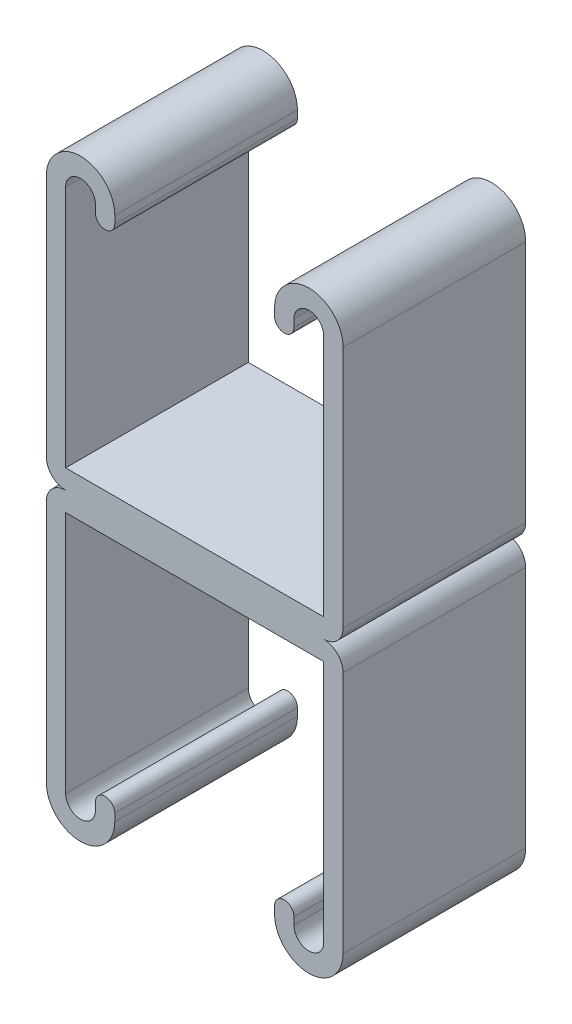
ISO-10303-21;
HEADER;
FILE_DESCRIPTION(('STEP AP214'),'2;1');
FILE_NAME('part.step','',(''),(''),'','','');
FILE_SCHEMA(('AUTOMOTIVE_DESIGN { 1 0 10303 214 1 1 1 1 }'));
ENDSEC;
DATA;
#1=APPLICATION_CONTEXT('core data for automotive mechanical design processes');
#2=APPLICATION_PROTOCOL_DEFINITION('international standard','automotive_design',2000,#1);
#3=PRODUCT_CONTEXT('',#1,'mechanical');
#4=PRODUCT('Part','Part','',(#3));
#5=PRODUCT_RELATED_PRODUCT_CATEGORY('part','',(#4));
#6=PRODUCT_DEFINITION_FORMATION('','',#4);
#7=PRODUCT_DEFINITION_CONTEXT('part definition',#1,'design');
#8=PRODUCT_DEFINITION('design','',#6,#7);
#9=PRODUCT_DEFINITION_SHAPE('','',#8);
#10=(LENGTH_UNIT() NAMED_UNIT(*) SI_UNIT(.MILLI.,.METRE.));
#11=(NAMED_UNIT(*) PLANE_ANGLE_UNIT() SI_UNIT($,.RADIAN.));
#12=(NAMED_UNIT(*) SI_UNIT($,.STERADIAN.) SOLID_ANGLE_UNIT());
#13=UNCERTAINTY_MEASURE_WITH_UNIT(LENGTH_MEASURE(1.E-05),#10,'distance_accuracy_value','');
#14=(GEOMETRIC_REPRESENTATION_CONTEXT(3) GLOBAL_UNCERTAINTY_ASSIGNED_CONTEXT((#13)) GLOBAL_UNIT_ASSIGNED_CONTEXT((#10,
#11,#12)) REPRESENTATION_CONTEXT('',''));
#15=CARTESIAN_POINT('',(0.,0.,0.));
#16=DIRECTION('',(0.,0.,1.));
#17=DIRECTION('',(1.,0.,0.));
#18=AXIS2_PLACEMENT_3D('',#15,#16,#17);
#19=CARTESIAN_POINT('',(-15.875,36.5125,12.7));
#20=DIRECTION('',(0.,0.,-1.));
#21=DIRECTION('',(-1.,0.,0.));
#22=AXIS2_PLACEMENT_3D('',#19,#20,#21);
#23=CYLINDRICAL_SURFACE('',#22,4.7625);
#24=CARTESIAN_POINT('',(-15.875,36.5125,-12.7));
#25=DIRECTION('',(0.,0.,1.));
#26=DIRECTION('',(-1.,0.,0.));
#27=AXIS2_PLACEMENT_3D('',#24,#25,#26);
#28=CIRCLE('',#27,4.7625);
#29=CARTESIAN_POINT('',(-11.1125,36.5125,-12.7));
#30=VERTEX_POINT('',#29);
#31=CARTESIAN_POINT('',(-20.6375,36.5125,-12.7));
#32=VERTEX_POINT('',#31);
#33=EDGE_CURVE('E190',#30,#32,#28,.T.);
#34=ORIENTED_EDGE('',*,*,#33,.T.);
#35=DIRECTION('',(0.,0.,-1.));
#36=VECTOR('',#35,1.);
#37=CARTESIAN_POINT('',(-20.6375,36.5125,12.7));
#38=LINE('',#37,#36);
#39=CARTESIAN_POINT('',(-20.6375,36.5125,12.7));
#40=VERTEX_POINT('',#39);
#41=EDGE_CURVE('E11',#40,#32,#38,.T.);
#42=ORIENTED_EDGE('',*,*,#41,.F.);
#43=CARTESIAN_POINT('',(-15.875,36.5125,12.7));
#44=DIRECTION('',(0.,0.,1.));
#45=DIRECTION('',(-1.,0.,0.));
#46=AXIS2_PLACEMENT_3D('',#43,#44,#45);
#47=CIRCLE('',#46,4.7625);
#48=CARTESIAN_POINT('',(-11.1125,36.5125,12.7));
#49=VERTEX_POINT('',#48);
#50=EDGE_CURVE('E223',#49,#40,#47,.T.);
#51=ORIENTED_EDGE('',*,*,#50,.F.);
#52=DIRECTION('',(0.,0.,-1.));
#53=VECTOR('',#52,1.);
#54=CARTESIAN_POINT('',(-11.1125,36.5125,12.7));
#55=LINE('',#54,#53);
#56=EDGE_CURVE('E186',#49,#30,#55,.T.);
#57=ORIENTED_EDGE('',*,*,#56,.T.);
#58=EDGE_LOOP('',(#34,#42,#51,#57));
#59=FACE_BOUND('',#58,.T.);
#60=ADVANCED_FACE('F33',(#59),#23,.T.);
#61=CARTESIAN_POINT('',(-20.6375,36.5125,12.7));
#62=DIRECTION('',(1.,0.,0.));
#63=DIRECTION('',(0.,1.,0.));
#64=AXIS2_PLACEMENT_3D('',#61,#62,#63);
#65=PLANE('',#64);
#66=DIRECTION('',(0.,-1.,0.));
#67=VECTOR('',#66,1.);
#68=CARTESIAN_POINT('',(-20.6375,36.5125,-12.7));
#69=LINE('',#68,#67);
#70=CARTESIAN_POINT('',(-20.6375,2.6924,-12.7));
#71=VERTEX_POINT('',#70);
#72=EDGE_CURVE('E193',#32,#71,#69,.T.);
#73=ORIENTED_EDGE('',*,*,#72,.T.);
#74=DIRECTION('',(0.,0.,-1.));
#75=VECTOR('',#74,1.);
#76=CARTESIAN_POINT('',(-20.6375,2.6924,12.7));
#77=LINE('',#76,#75);
#78=CARTESIAN_POINT('',(-20.6375,2.6924,12.7));
#79=VERTEX_POINT('',#78);
#80=EDGE_CURVE('E41',#79,#71,#77,.T.);
#81=ORIENTED_EDGE('',*,*,#80,.F.);
#82=DIRECTION('',(0.,-1.,0.));
#83=VECTOR('',#82,1.);
#84=CARTESIAN_POINT('',(-20.6375,36.5125,12.7));
#85=LINE('',#84,#83);
#86=EDGE_CURVE('E120',#40,#79,#85,.T.);
#87=ORIENTED_EDGE('',*,*,#86,.F.);
#88=ORIENTED_EDGE('',*,*,#41,.T.);
#89=EDGE_LOOP('',(#73,#81,#87,#88));
#90=FACE_BOUND('',#89,.T.);
#91=ADVANCED_FACE('F385',(#90),#65,.F.);
#92=CARTESIAN_POINT('',(-17.9451,2.6924,12.7));
#93=DIRECTION('',(0.,0.,-1.));
#94=DIRECTION('',(-1.,0.,0.));
#95=AXIS2_PLACEMENT_3D('',#92,#93,#94);
#96=CYLINDRICAL_SURFACE('',#95,2.6924);
#97=CARTESIAN_POINT('',(-17.9451,2.6924,-12.7));
#98=DIRECTION('',(0.,0.,1.));
#99=DIRECTION('',(-1.,0.,0.));
#100=AXIS2_PLACEMENT_3D('',#97,#98,#99);
#101=CIRCLE('',#100,2.6924);
#102=CARTESIAN_POINT('',(-17.9451,0.,-12.7));
#103=VERTEX_POINT('',#102);
#104=EDGE_CURVE('E196',#71,#103,#101,.T.);
#105=ORIENTED_EDGE('',*,*,#104,.T.);
#106=DIRECTION('',(0.,0.,-1.));
#107=VECTOR('',#106,1.);
#108=CARTESIAN_POINT('',(-17.9451,0.,12.7));
#109=LINE('',#108,#107);
#110=CARTESIAN_POINT('',(-17.9451,0.,12.7));
#111=VERTEX_POINT('',#110);
#112=EDGE_CURVE('E260',#111,#103,#109,.T.);
#113=ORIENTED_EDGE('',*,*,#112,.F.);
#114=CARTESIAN_POINT('',(-17.9451,2.6924,12.7));
#115=DIRECTION('',(0.,0.,1.));
#116=DIRECTION('',(-1.,0.,0.));
#117=AXIS2_PLACEMENT_3D('',#114,#115,#116);
#118=CIRCLE('',#117,2.6924);
#119=EDGE_CURVE('E268',#79,#111,#118,.T.);
#120=ORIENTED_EDGE('',*,*,#119,.F.);
#121=ORIENTED_EDGE('',*,*,#80,.T.);
#122=EDGE_LOOP('',(#105,#113,#120,#121));
#123=FACE_BOUND('',#122,.T.);
#124=ADVANCED_FACE('F266',(#123),#96,.T.);
#125=CARTESIAN_POINT('',(17.9451,2.6924,12.7));
#126=DIRECTION('',(0.,0.,-1.));
#127=DIRECTION('',(-1.,0.,0.));
#128=AXIS2_PLACEMENT_3D('',#125,#126,#127);
#129=CYLINDRICAL_SURFACE('',#128,2.6924);
#130=CARTESIAN_POINT('',(17.9451,2.6924,-12.7));
#131=DIRECTION('',(0.,0.,1.));
#132=DIRECTION('',(1.,0.,0.));
#133=AXIS2_PLACEMENT_3D('',#130,#131,#132);
#134=CIRCLE('',#133,2.6924);
#135=CARTESIAN_POINT('',(17.9451,0.,-12.7));
#136=VERTEX_POINT('',#135);
#137=CARTESIAN_POINT('',(20.6375,2.6924,-12.7));
#138=VERTEX_POINT('',#137);
#139=EDGE_CURVE('E198',#136,#138,#134,.T.);
#140=ORIENTED_EDGE('',*,*,#139,.T.);
#141=DIRECTION('',(0.,0.,-1.));
#142=VECTOR('',#141,1.);
#143=CARTESIAN_POINT('',(20.6375,2.6924,12.7));
#144=LINE('',#143,#142);
#145=CARTESIAN_POINT('',(20.6375,2.6924,12.7));
#146=VERTEX_POINT('',#145);
#147=EDGE_CURVE('E254',#146,#138,#144,.T.);
#148=ORIENTED_EDGE('',*,*,#147,.F.);
#149=CARTESIAN_POINT('',(17.9451,2.6924,12.7));
#150=DIRECTION('',(0.,0.,1.));
#151=DIRECTION('',(1.,0.,0.));
#152=AXIS2_PLACEMENT_3D('',#149,#150,#151);
#153=CIRCLE('',#152,2.6924);
#154=CARTESIAN_POINT('',(17.9451,0.,12.7));
#155=VERTEX_POINT('',#154);
#156=EDGE_CURVE('E342',#155,#146,#153,.T.);
#157=ORIENTED_EDGE('',*,*,#156,.F.);
#158=DIRECTION('',(0.,0.,-1.));
#159=VECTOR('',#158,1.);
#160=CARTESIAN_POINT('',(17.9451,0.,12.7));
#161=LINE('',#160,#159);
#162=EDGE_CURVE('E257',#155,#136,#161,.T.);
#163=ORIENTED_EDGE('',*,*,#162,.T.);
#164=EDGE_LOOP('',(#140,#148,#157,#163));
#165=FACE_BOUND('',#164,.T.);
#166=ADVANCED_FACE('F392',(#165),#129,.T.);
#167=CARTESIAN_POINT('',(20.6375,2.6924,12.7));
#168=DIRECTION('',(-1.,0.,0.));
#169=DIRECTION('',(0.,0.,1.));
#170=AXIS2_PLACEMENT_3D('',#167,#168,#169);
#171=PLANE('',#170);
#172=DIRECTION('',(0.,1.,0.));
#173=VECTOR('',#172,1.);
#174=CARTESIAN_POINT('',(20.6375,2.6924,-12.7));
#175=LINE('',#174,#173);
#176=CARTESIAN_POINT('',(20.6375,36.5125,-12.7));
#177=VERTEX_POINT('',#176);
#178=EDGE_CURVE('E200',#138,#177,#175,.T.);
#179=ORIENTED_EDGE('',*,*,#178,.T.);
#180=DIRECTION('',(0.,0.,-1.));
#181=VECTOR('',#180,1.);
#182=CARTESIAN_POINT('',(20.6375,36.5125,12.7));
#183=LINE('',#182,#181);
#184=CARTESIAN_POINT('',(20.6375,36.5125,12.7));
#185=VERTEX_POINT('',#184);
#186=EDGE_CURVE('E251',#185,#177,#183,.T.);
#187=ORIENTED_EDGE('',*,*,#186,.F.);
#188=DIRECTION('',(0.,1.,0.));
#189=VECTOR('',#188,1.);
#190=CARTESIAN_POINT('',(20.6375,2.6924,12.7));
#191=LINE('',#190,#189);
#192=EDGE_CURVE('E344',#146,#185,#191,.T.);
#193=ORIENTED_EDGE('',*,*,#192,.F.);
#194=ORIENTED_EDGE('',*,*,#147,.T.);
#195=EDGE_LOOP('',(#179,#187,#193,#194));
#196=FACE_BOUND('',#195,.T.);
#197=ADVANCED_FACE('F397',(#196),#171,.F.);
#198=CARTESIAN_POINT('',(15.875,36.5125,12.7));
#199=DIRECTION('',(0.,0.,-1.));
#200=DIRECTION('',(-1.,0.,0.));
#201=AXIS2_PLACEMENT_3D('',#198,#199,#200);
#202=CYLINDRICAL_SURFACE('',#201,4.7625);
#203=CARTESIAN_POINT('',(15.875,36.5125,-12.7));
#204=DIRECTION('',(0.,0.,1.));
#205=DIRECTION('',(1.,0.,0.));
#206=AXIS2_PLACEMENT_3D('',#203,#204,#205);
#207=CIRCLE('',#206,4.7625);
#208=CARTESIAN_POINT('',(11.1125,36.5125,-12.7));
#209=VERTEX_POINT('',#208);
#210=EDGE_CURVE('E202',#177,#209,#207,.T.);
#211=ORIENTED_EDGE('',*,*,#210,.T.);
#212=DIRECTION('',(0.,0.,-1.));
#213=VECTOR('',#212,1.);
#214=CARTESIAN_POINT('',(11.1125,36.5125,12.7));
#215=LINE('',#214,#213);
#216=CARTESIAN_POINT('',(11.1125,36.5125,12.7));
#217=VERTEX_POINT('',#216);
#218=EDGE_CURVE('E248',#217,#209,#215,.T.);
#219=ORIENTED_EDGE('',*,*,#218,.F.);
#220=CARTESIAN_POINT('',(15.875,36.5125,12.7));
#221=DIRECTION('',(0.,0.,1.));
#222=DIRECTION('',(1.,0.,0.));
#223=AXIS2_PLACEMENT_3D('',#220,#221,#222);
#224=CIRCLE('',#223,4.7625);
#225=EDGE_CURVE('E346',#185,#217,#224,.T.);
#226=ORIENTED_EDGE('',*,*,#225,.F.);
#227=ORIENTED_EDGE('',*,*,#186,.T.);
#228=EDGE_LOOP('',(#211,#219,#226,#227));
#229=FACE_BOUND('',#228,.T.);
#230=ADVANCED_FACE('F401',(#229),#202,.T.);
#231=CARTESIAN_POINT('',(11.1125,36.5125,12.7));
#232=DIRECTION('',(1.,0.,0.));
#233=DIRECTION('',(0.,1.,0.));
#234=AXIS2_PLACEMENT_3D('',#231,#232,#233);
#235=PLANE('',#234);
#236=DIRECTION('',(0.,-1.,0.));
#237=VECTOR('',#236,1.);
#238=CARTESIAN_POINT('',(11.1125,36.5125,-12.7));
#239=LINE('',#238,#237);
#240=CARTESIAN_POINT('',(11.1125,35.47745,-12.7));
#241=VERTEX_POINT('',#240);
#242=EDGE_CURVE('E204',#209,#241,#239,.T.);
#243=ORIENTED_EDGE('',*,*,#242,.T.);
#244=DIRECTION('',(0.,0.,-1.));
#245=VECTOR('',#244,1.);
#246=CARTESIAN_POINT('',(11.1125,35.47745,12.7));
#247=LINE('',#246,#245);
#248=CARTESIAN_POINT('',(11.1125,35.47745,12.7));
#249=VERTEX_POINT('',#248);
#250=EDGE_CURVE('E245',#249,#241,#247,.T.);
#251=ORIENTED_EDGE('',*,*,#250,.F.);
#252=DIRECTION('',(0.,-1.,0.));
#253=VECTOR('',#252,1.);
#254=CARTESIAN_POINT('',(11.1125,36.5125,12.7));
#255=LINE('',#254,#253);
#256=EDGE_CURVE('E348',#217,#249,#255,.T.);
#257=ORIENTED_EDGE('',*,*,#256,.F.);
#258=ORIENTED_EDGE('',*,*,#218,.T.);
#259=EDGE_LOOP('',(#243,#251,#257,#258));
#260=FACE_BOUND('',#259,.T.);
#261=ADVANCED_FACE('F405',(#260),#235,.F.);
#262=CARTESIAN_POINT('',(12.4587,35.47745,12.7));
#263=DIRECTION('',(0.,0.,-1.));
#264=DIRECTION('',(-1.,0.,0.));
#265=AXIS2_PLACEMENT_3D('',#262,#263,#264);
#266=CYLINDRICAL_SURFACE('',#265,1.3462);
#267=CARTESIAN_POINT('',(12.4587,35.47745,-12.7));
#268=DIRECTION('',(0.,0.,1.));
#269=DIRECTION('',(1.,0.,0.));
#270=AXIS2_PLACEMENT_3D('',#267,#268,#269);
#271=CIRCLE('',#270,1.3462);
#272=CARTESIAN_POINT('',(13.8049,35.47745,-12.7));
#273=VERTEX_POINT('',#272);
#274=EDGE_CURVE('E206',#241,#273,#271,.T.);
#275=ORIENTED_EDGE('',*,*,#274,.T.);
#276=DIRECTION('',(0.,0.,-1.));
#277=VECTOR('',#276,1.);
#278=CARTESIAN_POINT('',(13.8049,35.47745,12.7));
#279=LINE('',#278,#277);
#280=CARTESIAN_POINT('',(13.8049,35.47745,12.7));
#281=VERTEX_POINT('',#280);
#282=EDGE_CURVE('E242',#281,#273,#279,.T.);
#283=ORIENTED_EDGE('',*,*,#282,.F.);
#284=CARTESIAN_POINT('',(12.4587,35.47745,12.7));
#285=DIRECTION('',(0.,0.,1.));
#286=DIRECTION('',(1.,0.,0.));
#287=AXIS2_PLACEMENT_3D('',#284,#285,#286);
#288=CIRCLE('',#287,1.3462);
#289=EDGE_CURVE('E350',#249,#281,#288,.T.);
#290=ORIENTED_EDGE('',*,*,#289,.F.);
#291=ORIENTED_EDGE('',*,*,#250,.T.);
#292=EDGE_LOOP('',(#275,#283,#290,#291));
#293=FACE_BOUND('',#292,.T.);
#294=ADVANCED_FACE('F409',(#293),#266,.T.);
#295=CARTESIAN_POINT('',(13.8049,36.5125,12.7));
#296=DIRECTION('',(-1.,0.,0.));
#297=DIRECTION('',(0.,0.,1.));
#298=AXIS2_PLACEMENT_3D('',#295,#296,#297);
#299=PLANE('',#298);
#300=DIRECTION('',(0.,1.,0.));
#301=VECTOR('',#300,1.);
#302=CARTESIAN_POINT('',(13.8049,36.5125,-12.7));
#303=LINE('',#302,#301);
#304=CARTESIAN_POINT('',(13.8049,36.5125,-12.7));
#305=VERTEX_POINT('',#304);
#306=EDGE_CURVE('E208',#273,#305,#303,.T.);
#307=ORIENTED_EDGE('',*,*,#306,.T.);
#308=DIRECTION('',(0.,0.,-1.));
#309=VECTOR('',#308,1.);
#310=CARTESIAN_POINT('',(13.8049,36.5125,12.7));
#311=LINE('',#310,#309);
#312=CARTESIAN_POINT('',(13.8049,36.5125,12.7));
#313=VERTEX_POINT('',#312);
#314=EDGE_CURVE('E239',#313,#305,#311,.T.);
#315=ORIENTED_EDGE('',*,*,#314,.F.);
#316=DIRECTION('',(0.,1.,0.));
#317=VECTOR('',#316,1.);
#318=CARTESIAN_POINT('',(13.8049,36.5125,12.7));
#319=LINE('',#318,#317);
#320=EDGE_CURVE('E352',#281,#313,#319,.T.);
#321=ORIENTED_EDGE('',*,*,#320,.F.);
#322=ORIENTED_EDGE('',*,*,#282,.T.);
#323=EDGE_LOOP('',(#307,#315,#321,#322));
#324=FACE_BOUND('',#323,.T.);
#325=ADVANCED_FACE('F413',(#324),#299,.F.);
#326=CARTESIAN_POINT('',(15.875,36.5125,12.7));
#327=DIRECTION('',(0.,0.,-1.));
#328=DIRECTION('',(-1.,0.,0.));
#329=AXIS2_PLACEMENT_3D('',#326,#327,#328);
#330=CYLINDRICAL_SURFACE('',#329,2.0701);
#331=CARTESIAN_POINT('',(15.875,36.5125,-12.7));
#332=DIRECTION('',(0.,0.,-1.));
#333=DIRECTION('',(1.,0.,0.));
#334=AXIS2_PLACEMENT_3D('',#331,#332,#333);
#335=CIRCLE('',#334,2.0701);
#336=CARTESIAN_POINT('',(17.9451,36.5125,-12.7));
#337=VERTEX_POINT('',#336);
#338=EDGE_CURVE('E210',#305,#337,#335,.T.);
#339=ORIENTED_EDGE('',*,*,#338,.T.);
#340=DIRECTION('',(0.,0.,-1.));
#341=VECTOR('',#340,1.);
#342=CARTESIAN_POINT('',(17.9451,36.5125,12.7));
#343=LINE('',#342,#341);
#344=CARTESIAN_POINT('',(17.9451,36.5125,12.7));
#345=VERTEX_POINT('',#344);
#346=EDGE_CURVE('E236',#345,#337,#343,.T.);
#347=ORIENTED_EDGE('',*,*,#346,.F.);
#348=CARTESIAN_POINT('',(15.875,36.5125,12.7));
#349=DIRECTION('',(0.,0.,-1.));
#350=DIRECTION('',(1.,0.,0.));
#351=AXIS2_PLACEMENT_3D('',#348,#349,#350);
#352=CIRCLE('',#351,2.0701);
#353=EDGE_CURVE('E354',#313,#345,#352,.T.);
#354=ORIENTED_EDGE('',*,*,#353,.F.);
#355=ORIENTED_EDGE('',*,*,#314,.T.);
#356=EDGE_LOOP('',(#339,#347,#354,#355));
#357=FACE_BOUND('',#356,.T.);
#358=ADVANCED_FACE('F417',(#357),#330,.F.);
#359=CARTESIAN_POINT('',(17.9451,2.6924,12.7));
#360=DIRECTION('',(1.,0.,0.));
#361=DIRECTION('',(0.,1.,0.));
#362=AXIS2_PLACEMENT_3D('',#359,#360,#361);
#363=PLANE('',#362);
#364=DIRECTION('',(0.,-1.,0.));
#365=VECTOR('',#364,1.);
#366=CARTESIAN_POINT('',(17.9451,2.6924,-12.7));
#367=LINE('',#366,#365);
#368=CARTESIAN_POINT('',(17.9451,2.6924,-12.7));
#369=VERTEX_POINT('',#368);
#370=EDGE_CURVE('E212',#337,#369,#367,.T.);
#371=ORIENTED_EDGE('',*,*,#370,.T.);
#372=DIRECTION('',(0.,0.,-1.));
#373=VECTOR('',#372,1.);
#374=CARTESIAN_POINT('',(17.9451,2.6924,12.7));
#375=LINE('',#374,#373);
#376=CARTESIAN_POINT('',(17.9451,2.6924,12.7));
#377=VERTEX_POINT('',#376);
#378=EDGE_CURVE('E233',#377,#369,#375,.T.);
#379=ORIENTED_EDGE('',*,*,#378,.F.);
#380=DIRECTION('',(0.,-1.,0.));
#381=VECTOR('',#380,1.);
#382=CARTESIAN_POINT('',(17.9451,2.6924,12.7));
#383=LINE('',#382,#381);
#384=EDGE_CURVE('E356',#345,#377,#383,.T.);
#385=ORIENTED_EDGE('',*,*,#384,.F.);
#386=ORIENTED_EDGE('',*,*,#346,.T.);
#387=EDGE_LOOP('',(#371,#379,#385,#386));
#388=FACE_BOUND('',#387,.T.);
#389=ADVANCED_FACE('F421',(#388),#363,.F.);
#390=CARTESIAN_POINT('',(-17.9451,2.6924,12.7));
#391=DIRECTION('',(0.,-1.,0.));
#392=DIRECTION('',(1.,0.,0.));
#393=AXIS2_PLACEMENT_3D('',#390,#391,#392);
#394=PLANE('',#393);
#395=DIRECTION('',(-1.,0.,0.));
#396=VECTOR('',#395,1.);
#397=CARTESIAN_POINT('',(-17.9451,2.6924,-12.7));
#398=LINE('',#397,#396);
#399=CARTESIAN_POINT('',(-17.9451,2.6924,-12.7));
#400=VERTEX_POINT('',#399);
#401=EDGE_CURVE('E214',#369,#400,#398,.T.);
#402=ORIENTED_EDGE('',*,*,#401,.T.);
#403=DIRECTION('',(0.,0.,-1.));
#404=VECTOR('',#403,1.);
#405=CARTESIAN_POINT('',(-17.9451,2.6924,12.7));
#406=LINE('',#405,#404);
#407=CARTESIAN_POINT('',(-17.9451,2.6924,12.7));
#408=VERTEX_POINT('',#407);
#409=EDGE_CURVE('E230',#408,#400,#406,.T.);
#410=ORIENTED_EDGE('',*,*,#409,.F.);
#411=DIRECTION('',(-1.,0.,0.));
#412=VECTOR('',#411,1.);
#413=CARTESIAN_POINT('',(-17.9451,2.6924,12.7));
#414=LINE('',#413,#412);
#415=EDGE_CURVE('E358',#377,#408,#414,.T.);
#416=ORIENTED_EDGE('',*,*,#415,.F.);
#417=ORIENTED_EDGE('',*,*,#378,.T.);
#418=EDGE_LOOP('',(#402,#410,#416,#417));
#419=FACE_BOUND('',#418,.T.);
#420=ADVANCED_FACE('F425',(#419),#394,.F.);
#421=CARTESIAN_POINT('',(-17.9451,36.5125,12.7));
#422=DIRECTION('',(-1.,0.,0.));
#423=DIRECTION('',(0.,-1.,0.));
#424=AXIS2_PLACEMENT_3D('',#421,#422,#423);
#425=PLANE('',#424);
#426=DIRECTION('',(0.,1.,0.));
#427=VECTOR('',#426,1.);
#428=CARTESIAN_POINT('',(-17.9451,36.5125,-12.7));
#429=LINE('',#428,#427);
#430=CARTESIAN_POINT('',(-17.9451,36.5125,-12.7));
#431=VERTEX_POINT('',#430);
#432=EDGE_CURVE('E216',#400,#431,#429,.T.);
#433=ORIENTED_EDGE('',*,*,#432,.T.);
#434=DIRECTION('',(0.,0.,-1.));
#435=VECTOR('',#434,1.);
#436=CARTESIAN_POINT('',(-17.9451,36.5125,12.7));
#437=LINE('',#436,#435);
#438=CARTESIAN_POINT('',(-17.9451,36.5125,12.7));
#439=VERTEX_POINT('',#438);
#440=EDGE_CURVE('E227',#439,#431,#437,.T.);
#441=ORIENTED_EDGE('',*,*,#440,.F.);
#442=DIRECTION('',(0.,1.,0.));
#443=VECTOR('',#442,1.);
#444=CARTESIAN_POINT('',(-17.9451,36.5125,12.7));
#445=LINE('',#444,#443);
#446=EDGE_CURVE('E360',#408,#439,#445,.T.);
#447=ORIENTED_EDGE('',*,*,#446,.F.);
#448=ORIENTED_EDGE('',*,*,#409,.T.);
#449=EDGE_LOOP('',(#433,#441,#447,#448));
#450=FACE_BOUND('',#449,.T.);
#451=ADVANCED_FACE('F366',(#450),#425,.F.);
#452=CARTESIAN_POINT('',(-15.875,36.5125,12.7));
#453=DIRECTION('',(0.,0.,-1.));
#454=DIRECTION('',(-1.,0.,0.));
#455=AXIS2_PLACEMENT_3D('',#452,#453,#454);
#456=CYLINDRICAL_SURFACE('',#455,2.0701);
#457=CARTESIAN_POINT('',(-15.875,36.5125,-12.7));
#458=DIRECTION('',(0.,0.,-1.));
#459=DIRECTION('',(-1.,0.,0.));
#460=AXIS2_PLACEMENT_3D('',#457,#458,#459);
#461=CIRCLE('',#460,2.0701);
#462=CARTESIAN_POINT('',(-13.8049,36.5125,-12.7));
#463=VERTEX_POINT('',#462);
#464=EDGE_CURVE('E218',#431,#463,#461,.T.);
#465=ORIENTED_EDGE('',*,*,#464,.T.);
#466=DIRECTION('',(0.,0.,-1.));
#467=VECTOR('',#466,1.);
#468=CARTESIAN_POINT('',(-13.8049,36.5125,12.7));
#469=LINE('',#468,#467);
#470=CARTESIAN_POINT('',(-13.8049,36.5125,12.7));
#471=VERTEX_POINT('',#470);
#472=EDGE_CURVE('E181',#471,#463,#469,.T.);
#473=ORIENTED_EDGE('',*,*,#472,.F.);
#474=CARTESIAN_POINT('',(-15.875,36.5125,12.7));
#475=DIRECTION('',(0.,0.,-1.));
#476=DIRECTION('',(-1.,0.,0.));
#477=AXIS2_PLACEMENT_3D('',#474,#475,#476);
#478=CIRCLE('',#477,2.0701);
#479=EDGE_CURVE('E172',#439,#471,#478,.T.);
#480=ORIENTED_EDGE('',*,*,#479,.F.);
#481=ORIENTED_EDGE('',*,*,#440,.T.);
#482=EDGE_LOOP('',(#465,#473,#480,#481));
#483=FACE_BOUND('',#482,.T.);
#484=ADVANCED_FACE('F370',(#483),#456,.F.);
#485=CARTESIAN_POINT('',(-13.8049,36.5125,12.7));
#486=DIRECTION('',(1.,0.,0.));
#487=DIRECTION('',(0.,1.,0.));
#488=AXIS2_PLACEMENT_3D('',#485,#486,#487);
#489=PLANE('',#488);
#490=DIRECTION('',(0.,-1.,0.));
#491=VECTOR('',#490,1.);
#492=CARTESIAN_POINT('',(-13.8049,36.5125,-12.7));
#493=LINE('',#492,#491);
#494=CARTESIAN_POINT('',(-13.8049,35.47745,-12.7));
#495=VERTEX_POINT('',#494);
#496=EDGE_CURVE('E180',#463,#495,#493,.T.);
#497=ORIENTED_EDGE('',*,*,#496,.T.);
#498=DIRECTION('',(0.,0.,-1.));
#499=VECTOR('',#498,1.);
#500=CARTESIAN_POINT('',(-13.8049,35.47745,12.7));
#501=LINE('',#500,#499);
#502=CARTESIAN_POINT('',(-13.8049,35.47745,12.7));
#503=VERTEX_POINT('',#502);
#504=EDGE_CURVE('E177',#503,#495,#501,.T.);
#505=ORIENTED_EDGE('',*,*,#504,.F.);
#506=DIRECTION('',(0.,-1.,0.));
#507=VECTOR('',#506,1.);
#508=CARTESIAN_POINT('',(-13.8049,36.5125,12.7));
#509=LINE('',#508,#507);
#510=EDGE_CURVE('E166',#471,#503,#509,.T.);
#511=ORIENTED_EDGE('',*,*,#510,.F.);
#512=ORIENTED_EDGE('',*,*,#472,.T.);
#513=EDGE_LOOP('',(#497,#505,#511,#512));
#514=FACE_BOUND('',#513,.T.);
#515=ADVANCED_FACE('F178',(#514),#489,.F.);
#516=CARTESIAN_POINT('',(-12.4587,35.47745,12.7));
#517=DIRECTION('',(0.,0.,-1.));
#518=DIRECTION('',(-1.,0.,0.));
#519=AXIS2_PLACEMENT_3D('',#516,#517,#518);
#520=CYLINDRICAL_SURFACE('',#519,1.3462);
#521=CARTESIAN_POINT('',(-12.4587,35.47745,-12.7));
#522=DIRECTION('',(0.,0.,1.));
#523=DIRECTION('',(-1.,0.,0.));
#524=AXIS2_PLACEMENT_3D('',#521,#522,#523);
#525=CIRCLE('',#524,1.3462);
#526=CARTESIAN_POINT('',(-11.1125,35.47745,-12.7));
#527=VERTEX_POINT('',#526);
#528=EDGE_CURVE('E106',#495,#527,#525,.T.);
#529=ORIENTED_EDGE('',*,*,#528,.T.);
#530=DIRECTION('',(0.,0.,-1.));
#531=VECTOR('',#530,1.);
#532=CARTESIAN_POINT('',(-11.1125,35.47745,12.7));
#533=LINE('',#532,#531);
#534=CARTESIAN_POINT('',(-11.1125,35.47745,12.7));
#535=VERTEX_POINT('',#534);
#536=EDGE_CURVE('E182',#535,#527,#533,.T.);
#537=ORIENTED_EDGE('',*,*,#536,.F.);
#538=CARTESIAN_POINT('',(-12.4587,35.47745,12.7));
#539=DIRECTION('',(0.,0.,1.));
#540=DIRECTION('',(-1.,0.,0.));
#541=AXIS2_PLACEMENT_3D('',#538,#539,#540);
#542=CIRCLE('',#541,1.3462);
#543=EDGE_CURVE('E170',#503,#535,#542,.T.);
#544=ORIENTED_EDGE('',*,*,#543,.F.);
#545=ORIENTED_EDGE('',*,*,#504,.T.);
#546=EDGE_LOOP('',(#529,#537,#544,#545));
#547=FACE_BOUND('',#546,.T.);
#548=ADVANCED_FACE('F184',(#547),#520,.T.);
#549=CARTESIAN_POINT('',(-11.1125,36.5125,12.7));
#550=DIRECTION('',(-1.,0.,0.));
#551=DIRECTION('',(0.,0.,1.));
#552=AXIS2_PLACEMENT_3D('',#549,#550,#551);
#553=PLANE('',#552);
#554=DIRECTION('',(0.,1.,0.));
#555=VECTOR('',#554,1.);
#556=CARTESIAN_POINT('',(-11.1125,36.5125,-12.7));
#557=LINE('',#556,#555);
#558=EDGE_CURVE('E112',#527,#30,#557,.T.);
#559=ORIENTED_EDGE('',*,*,#558,.T.);
#560=ORIENTED_EDGE('',*,*,#56,.F.);
#561=DIRECTION('',(0.,1.,0.));
#562=VECTOR('',#561,1.);
#563=CARTESIAN_POINT('',(-11.1125,36.5125,12.7));
#564=LINE('',#563,#562);
#565=EDGE_CURVE('E49',#535,#49,#564,.T.);
#566=ORIENTED_EDGE('',*,*,#565,.F.);
#567=ORIENTED_EDGE('',*,*,#536,.T.);
#568=EDGE_LOOP('',(#559,#560,#566,#567));
#569=FACE_BOUND('',#568,.T.);
#570=ADVANCED_FACE('F374',(#569),#553,.F.);
#571=CARTESIAN_POINT('',(-15.875,36.5125,12.7));
#572=DIRECTION('',(0.,0.,-1.));
#573=DIRECTION('',(-1.,0.,0.));
#574=AXIS2_PLACEMENT_3D('',#571,#572,#573);
#575=PLANE('',#574);
#576=ORIENTED_EDGE('',*,*,#50,.T.);
#577=ORIENTED_EDGE('',*,*,#86,.T.);
#578=ORIENTED_EDGE('',*,*,#119,.T.);
#579=CARTESIAN_POINT('',(-17.9451,-2.6924,12.7));
#580=DIRECTION('',(0.,0.,-1.));
#581=DIRECTION('',(-1.,0.,0.));
#582=AXIS2_PLACEMENT_3D('',#579,#580,#581);
#583=CIRCLE('',#582,2.6924);
#584=CARTESIAN_POINT('',(-20.6375,-2.6924,12.7));
#585=VERTEX_POINT('',#584);
#586=EDGE_CURVE('E783',#585,#111,#583,.T.);
#587=ORIENTED_EDGE('',*,*,#586,.F.);
#588=DIRECTION('',(0.,1.,0.));
#589=VECTOR('',#588,1.);
#590=CARTESIAN_POINT('',(-20.6375,-36.5125,12.7));
#591=LINE('',#590,#589);
#592=CARTESIAN_POINT('',(-20.6375,-36.5125,12.7));
#593=VERTEX_POINT('',#592);
#594=EDGE_CURVE('E295',#593,#585,#591,.T.);
#595=ORIENTED_EDGE('',*,*,#594,.F.);
#596=CARTESIAN_POINT('',(-15.875,-36.5125,12.7));
#597=DIRECTION('',(0.,0.,-1.));
#598=DIRECTION('',(-1.,0.,0.));
#599=AXIS2_PLACEMENT_3D('',#596,#597,#598);
#600=CIRCLE('',#599,4.7625);
#601=CARTESIAN_POINT('',(-11.1125,-36.5125,12.7));
#602=VERTEX_POINT('',#601);
#603=EDGE_CURVE('E284',#602,#593,#600,.T.);
#604=ORIENTED_EDGE('',*,*,#603,.F.);
#605=DIRECTION('',(0.,-1.,0.));
#606=VECTOR('',#605,1.);
#607=CARTESIAN_POINT('',(-11.1125,-36.5125,12.7));
#608=LINE('',#607,#606);
#609=CARTESIAN_POINT('',(-11.1125,-35.47745,12.7));
#610=VERTEX_POINT('',#609);
#611=EDGE_CURVE('E732',#610,#602,#608,.T.);
#612=ORIENTED_EDGE('',*,*,#611,.F.);
#613=CARTESIAN_POINT('',(-12.4587,-35.47745,12.7));
#614=DIRECTION('',(0.,0.,-1.));
#615=DIRECTION('',(-1.,0.,0.));
#616=AXIS2_PLACEMENT_3D('',#613,#614,#615);
#617=CIRCLE('',#616,1.3462);
#618=CARTESIAN_POINT('',(-13.8049,-35.47745,12.7));
#619=VERTEX_POINT('',#618);
#620=EDGE_CURVE('E741',#619,#610,#617,.T.);
#621=ORIENTED_EDGE('',*,*,#620,.F.);
#622=DIRECTION('',(0.,1.,0.));
#623=VECTOR('',#622,1.);
#624=CARTESIAN_POINT('',(-13.8049,-36.5125,12.7));
#625=LINE('',#624,#623);
#626=CARTESIAN_POINT('',(-13.8049,-36.5125,12.7));
#627=VERTEX_POINT('',#626);
#628=EDGE_CURVE('E745',#627,#619,#625,.T.);
#629=ORIENTED_EDGE('',*,*,#628,.F.);
#630=CARTESIAN_POINT('',(-15.875,-36.5125,12.7));
#631=DIRECTION('',(0.,0.,1.));
#632=DIRECTION('',(-1.,0.,0.));
#633=AXIS2_PLACEMENT_3D('',#630,#631,#632);
#634=CIRCLE('',#633,2.0701);
#635=CARTESIAN_POINT('',(-17.9451,-36.5125,12.7));
#636=VERTEX_POINT('',#635);
#637=EDGE_CURVE('E747',#636,#627,#634,.T.);
#638=ORIENTED_EDGE('',*,*,#637,.F.);
#639=DIRECTION('',(0.,-1.,0.));
#640=VECTOR('',#639,1.);
#641=CARTESIAN_POINT('',(-17.9451,-36.5125,12.7));
#642=LINE('',#641,#640);
#643=CARTESIAN_POINT('',(-17.9451,-2.6924,12.7));
#644=VERTEX_POINT('',#643);
#645=EDGE_CURVE('E753',#644,#636,#642,.T.);
#646=ORIENTED_EDGE('',*,*,#645,.F.);
#647=DIRECTION('',(-1.,0.,0.));
#648=VECTOR('',#647,1.);
#649=CARTESIAN_POINT('',(-17.9451,-2.6924,12.7));
#650=LINE('',#649,#648);
#651=CARTESIAN_POINT('',(17.9451,-2.6924,12.7));
#652=VERTEX_POINT('',#651);
#653=EDGE_CURVE('E756',#652,#644,#650,.T.);
#654=ORIENTED_EDGE('',*,*,#653,.F.);
#655=DIRECTION('',(0.,1.,0.));
#656=VECTOR('',#655,1.);
#657=CARTESIAN_POINT('',(17.9451,-2.6924,12.7));
#658=LINE('',#657,#656);
#659=CARTESIAN_POINT('',(17.9451,-36.5125,12.7));
#660=VERTEX_POINT('',#659);
#661=EDGE_CURVE('E759',#660,#652,#658,.T.);
#662=ORIENTED_EDGE('',*,*,#661,.F.);
#663=CARTESIAN_POINT('',(15.875,-36.5125,12.7));
#664=DIRECTION('',(0.,0.,1.));
#665=DIRECTION('',(1.,0.,0.));
#666=AXIS2_PLACEMENT_3D('',#663,#664,#665);
#667=CIRCLE('',#666,2.0701);
#668=CARTESIAN_POINT('',(13.8049,-36.5125,12.7));
#669=VERTEX_POINT('',#668);
#670=EDGE_CURVE('E762',#669,#660,#667,.T.);
#671=ORIENTED_EDGE('',*,*,#670,.F.);
#672=DIRECTION('',(0.,-1.,0.));
#673=VECTOR('',#672,1.);
#674=CARTESIAN_POINT('',(13.8049,-36.5125,12.7));
#675=LINE('',#674,#673);
#676=CARTESIAN_POINT('',(13.8049,-35.47745,12.7));
#677=VERTEX_POINT('',#676);
#678=EDGE_CURVE('E765',#677,#669,#675,.T.);
#679=ORIENTED_EDGE('',*,*,#678,.F.);
#680=CARTESIAN_POINT('',(12.4587,-35.47745,12.7));
#681=DIRECTION('',(0.,0.,-1.));
#682=DIRECTION('',(1.,0.,0.));
#683=AXIS2_PLACEMENT_3D('',#680,#681,#682);
#684=CIRCLE('',#683,1.3462);
#685=CARTESIAN_POINT('',(11.1125,-35.47745,12.7));
#686=VERTEX_POINT('',#685);
#687=EDGE_CURVE('E768',#686,#677,#684,.T.);
#688=ORIENTED_EDGE('',*,*,#687,.F.);
#689=DIRECTION('',(0.,1.,0.));
#690=VECTOR('',#689,1.);
#691=CARTESIAN_POINT('',(11.1125,-36.5125,12.7));
#692=LINE('',#691,#690);
#693=CARTESIAN_POINT('',(11.1125,-36.5125,12.7));
#694=VERTEX_POINT('',#693);
#695=EDGE_CURVE('E771',#694,#686,#692,.T.);
#696=ORIENTED_EDGE('',*,*,#695,.F.);
#697=CARTESIAN_POINT('',(15.875,-36.5125,12.7));
#698=DIRECTION('',(0.,0.,-1.));
#699=DIRECTION('',(1.,0.,0.));
#700=AXIS2_PLACEMENT_3D('',#697,#698,#699);
#701=CIRCLE('',#700,4.7625);
#702=CARTESIAN_POINT('',(20.6375,-36.5125,12.7));
#703=VERTEX_POINT('',#702);
#704=EDGE_CURVE('E774',#703,#694,#701,.T.);
#705=ORIENTED_EDGE('',*,*,#704,.F.);
#706=DIRECTION('',(0.,-1.,0.));
#707=VECTOR('',#706,1.);
#708=CARTESIAN_POINT('',(20.6375,-2.6924,12.7));
#709=LINE('',#708,#707);
#710=CARTESIAN_POINT('',(20.6375,-2.6924,12.7));
#711=VERTEX_POINT('',#710);
#712=EDGE_CURVE('E777',#711,#703,#709,.T.);
#713=ORIENTED_EDGE('',*,*,#712,.F.);
#714=CARTESIAN_POINT('',(17.9451,-2.6924,12.7));
#715=DIRECTION('',(0.,0.,-1.));
#716=DIRECTION('',(1.,0.,0.));
#717=AXIS2_PLACEMENT_3D('',#714,#715,#716);
#718=CIRCLE('',#717,2.6924);
#719=EDGE_CURVE('E780',#155,#711,#718,.T.);
#720=ORIENTED_EDGE('',*,*,#719,.F.);
#721=ORIENTED_EDGE('',*,*,#156,.T.);
#722=ORIENTED_EDGE('',*,*,#192,.T.);
#723=ORIENTED_EDGE('',*,*,#225,.T.);
#724=ORIENTED_EDGE('',*,*,#256,.T.);
#725=ORIENTED_EDGE('',*,*,#289,.T.);
#726=ORIENTED_EDGE('',*,*,#320,.T.);
#727=ORIENTED_EDGE('',*,*,#353,.T.);
#728=ORIENTED_EDGE('',*,*,#384,.T.);
#729=ORIENTED_EDGE('',*,*,#415,.T.);
#730=ORIENTED_EDGE('',*,*,#446,.T.);
#731=ORIENTED_EDGE('',*,*,#479,.T.);
#732=ORIENTED_EDGE('',*,*,#510,.T.);
#733=ORIENTED_EDGE('',*,*,#543,.T.);
#734=ORIENTED_EDGE('',*,*,#565,.T.);
#735=EDGE_LOOP('',(#576,#577,#578,#587,#595,#604,#612,#621,#629,#638,#646,#654,#662,#671,#679,
#688,#696,#705,#713,#720,#721,#722,#723,#724,#725,#726,#727,#728,#729,#730,#731,#732,#733,#734));
#736=FACE_BOUND('',#735,.T.);
#737=ADVANCED_FACE('F168',(#736),#575,.F.);
#738=CARTESIAN_POINT('',(-15.875,36.5125,-12.7));
#739=DIRECTION('',(0.,0.,-1.));
#740=DIRECTION('',(-1.,0.,0.));
#741=AXIS2_PLACEMENT_3D('',#738,#739,#740);
#742=PLANE('',#741);
#743=ORIENTED_EDGE('',*,*,#33,.F.);
#744=ORIENTED_EDGE('',*,*,#558,.F.);
#745=ORIENTED_EDGE('',*,*,#528,.F.);
#746=ORIENTED_EDGE('',*,*,#496,.F.);
#747=ORIENTED_EDGE('',*,*,#464,.F.);
#748=ORIENTED_EDGE('',*,*,#432,.F.);
#749=ORIENTED_EDGE('',*,*,#401,.F.);
#750=ORIENTED_EDGE('',*,*,#370,.F.);
#751=ORIENTED_EDGE('',*,*,#338,.F.);
#752=ORIENTED_EDGE('',*,*,#306,.F.);
#753=ORIENTED_EDGE('',*,*,#274,.F.);
#754=ORIENTED_EDGE('',*,*,#242,.F.);
#755=ORIENTED_EDGE('',*,*,#210,.F.);
#756=ORIENTED_EDGE('',*,*,#178,.F.);
#757=ORIENTED_EDGE('',*,*,#139,.F.);
#758=CARTESIAN_POINT('',(17.9451,-2.6924,-12.7));
#759=DIRECTION('',(0.,0.,-1.));
#760=DIRECTION('',(1.,0.,0.));
#761=AXIS2_PLACEMENT_3D('',#758,#759,#760);
#762=CIRCLE('',#761,2.6924);
#763=CARTESIAN_POINT('',(20.6375,-2.6924,-12.7));
#764=VERTEX_POINT('',#763);
#765=EDGE_CURVE('E282',#136,#764,#762,.T.);
#766=ORIENTED_EDGE('',*,*,#765,.T.);
#767=DIRECTION('',(0.,-1.,0.));
#768=VECTOR('',#767,1.);
#769=CARTESIAN_POINT('',(20.6375,-2.6924,-12.7));
#770=LINE('',#769,#768);
#771=CARTESIAN_POINT('',(20.6375,-36.5125,-12.7));
#772=VERTEX_POINT('',#771);
#773=EDGE_CURVE('E287',#764,#772,#770,.T.);
#774=ORIENTED_EDGE('',*,*,#773,.T.);
#775=CARTESIAN_POINT('',(15.875,-36.5125,-12.7));
#776=DIRECTION('',(0.,0.,-1.));
#777=DIRECTION('',(1.,0.,0.));
#778=AXIS2_PLACEMENT_3D('',#775,#776,#777);
#779=CIRCLE('',#778,4.7625);
#780=CARTESIAN_POINT('',(11.1125,-36.5125,-12.7));
#781=VERTEX_POINT('',#780);
#782=EDGE_CURVE('E819',#772,#781,#779,.T.);
#783=ORIENTED_EDGE('',*,*,#782,.T.);
#784=DIRECTION('',(0.,1.,0.));
#785=VECTOR('',#784,1.);
#786=CARTESIAN_POINT('',(11.1125,-36.5125,-12.7));
#787=LINE('',#786,#785);
#788=CARTESIAN_POINT('',(11.1125,-35.47745,-12.7));
#789=VERTEX_POINT('',#788);
#790=EDGE_CURVE('E816',#781,#789,#787,.T.);
#791=ORIENTED_EDGE('',*,*,#790,.T.);
#792=CARTESIAN_POINT('',(12.4587,-35.47745,-12.7));
#793=DIRECTION('',(0.,0.,-1.));
#794=DIRECTION('',(1.,0.,0.));
#795=AXIS2_PLACEMENT_3D('',#792,#793,#794);
#796=CIRCLE('',#795,1.3462);
#797=CARTESIAN_POINT('',(13.8049,-35.47745,-12.7));
#798=VERTEX_POINT('',#797);
#799=EDGE_CURVE('E813',#789,#798,#796,.T.);
#800=ORIENTED_EDGE('',*,*,#799,.T.);
#801=DIRECTION('',(0.,-1.,0.));
#802=VECTOR('',#801,1.);
#803=CARTESIAN_POINT('',(13.8049,-36.5125,-12.7));
#804=LINE('',#803,#802);
#805=CARTESIAN_POINT('',(13.8049,-36.5125,-12.7));
#806=VERTEX_POINT('',#805);
#807=EDGE_CURVE('E810',#798,#806,#804,.T.);
#808=ORIENTED_EDGE('',*,*,#807,.T.);
#809=CARTESIAN_POINT('',(15.875,-36.5125,-12.7));
#810=DIRECTION('',(0.,0.,1.));
#811=DIRECTION('',(1.,0.,0.));
#812=AXIS2_PLACEMENT_3D('',#809,#810,#811);
#813=CIRCLE('',#812,2.0701);
#814=CARTESIAN_POINT('',(17.9451,-36.5125,-12.7));
#815=VERTEX_POINT('',#814);
#816=EDGE_CURVE('E807',#806,#815,#813,.T.);
#817=ORIENTED_EDGE('',*,*,#816,.T.);
#818=DIRECTION('',(0.,1.,0.));
#819=VECTOR('',#818,1.);
#820=CARTESIAN_POINT('',(17.9451,-2.6924,-12.7));
#821=LINE('',#820,#819);
#822=CARTESIAN_POINT('',(17.9451,-2.6924,-12.7));
#823=VERTEX_POINT('',#822);
#824=EDGE_CURVE('E804',#815,#823,#821,.T.);
#825=ORIENTED_EDGE('',*,*,#824,.T.);
#826=DIRECTION('',(-1.,0.,0.));
#827=VECTOR('',#826,1.);
#828=CARTESIAN_POINT('',(-17.9451,-2.6924,-12.7));
#829=LINE('',#828,#827);
#830=CARTESIAN_POINT('',(-17.9451,-2.6924,-12.7));
#831=VERTEX_POINT('',#830);
#832=EDGE_CURVE('E801',#823,#831,#829,.T.);
#833=ORIENTED_EDGE('',*,*,#832,.T.);
#834=DIRECTION('',(0.,-1.,0.));
#835=VECTOR('',#834,1.);
#836=CARTESIAN_POINT('',(-17.9451,-36.5125,-12.7));
#837=LINE('',#836,#835);
#838=CARTESIAN_POINT('',(-17.9451,-36.5125,-12.7));
#839=VERTEX_POINT('',#838);
#840=EDGE_CURVE('E798',#831,#839,#837,.T.);
#841=ORIENTED_EDGE('',*,*,#840,.T.);
#842=CARTESIAN_POINT('',(-15.875,-36.5125,-12.7));
#843=DIRECTION('',(0.,0.,1.));
#844=DIRECTION('',(-1.,0.,0.));
#845=AXIS2_PLACEMENT_3D('',#842,#843,#844);
#846=CIRCLE('',#845,2.0701);
#847=CARTESIAN_POINT('',(-13.8049,-36.5125,-12.7));
#848=VERTEX_POINT('',#847);
#849=EDGE_CURVE('E795',#839,#848,#846,.T.);
#850=ORIENTED_EDGE('',*,*,#849,.T.);
#851=DIRECTION('',(0.,1.,0.));
#852=VECTOR('',#851,1.);
#853=CARTESIAN_POINT('',(-13.8049,-36.5125,-12.7));
#854=LINE('',#853,#852);
#855=CARTESIAN_POINT('',(-13.8049,-35.47745,-12.7));
#856=VERTEX_POINT('',#855);
#857=EDGE_CURVE('E792',#848,#856,#854,.T.);
#858=ORIENTED_EDGE('',*,*,#857,.T.);
#859=CARTESIAN_POINT('',(-12.4587,-35.47745,-12.7));
#860=DIRECTION('',(0.,0.,-1.));
#861=DIRECTION('',(-1.,0.,0.));
#862=AXIS2_PLACEMENT_3D('',#859,#860,#861);
#863=CIRCLE('',#862,1.3462);
#864=CARTESIAN_POINT('',(-11.1125,-35.47745,-12.7));
#865=VERTEX_POINT('',#864);
#866=EDGE_CURVE('E790',#856,#865,#863,.T.);
#867=ORIENTED_EDGE('',*,*,#866,.T.);
#868=DIRECTION('',(0.,-1.,0.));
#869=VECTOR('',#868,1.);
#870=CARTESIAN_POINT('',(-11.1125,-36.5125,-12.7));
#871=LINE('',#870,#869);
#872=CARTESIAN_POINT('',(-11.1125,-36.5125,-12.7));
#873=VERTEX_POINT('',#872);
#874=EDGE_CURVE('E734',#865,#873,#871,.T.);
#875=ORIENTED_EDGE('',*,*,#874,.T.);
#876=CARTESIAN_POINT('',(-15.875,-36.5125,-12.7));
#877=DIRECTION('',(0.,0.,-1.));
#878=DIRECTION('',(-1.,0.,0.));
#879=AXIS2_PLACEMENT_3D('',#876,#877,#878);
#880=CIRCLE('',#879,4.7625);
#881=CARTESIAN_POINT('',(-20.6375,-36.5125,-12.7));
#882=VERTEX_POINT('',#881);
#883=EDGE_CURVE('E787',#873,#882,#880,.T.);
#884=ORIENTED_EDGE('',*,*,#883,.T.);
#885=DIRECTION('',(0.,1.,0.));
#886=VECTOR('',#885,1.);
#887=CARTESIAN_POINT('',(-20.6375,-36.5125,-12.7));
#888=LINE('',#887,#886);
#889=CARTESIAN_POINT('',(-20.6375,-2.6924,-12.7));
#890=VERTEX_POINT('',#889);
#891=EDGE_CURVE('E279',#882,#890,#888,.T.);
#892=ORIENTED_EDGE('',*,*,#891,.T.);
#893=CARTESIAN_POINT('',(-17.9451,-2.6924,-12.7));
#894=DIRECTION('',(0.,0.,-1.));
#895=DIRECTION('',(-1.,0.,0.));
#896=AXIS2_PLACEMENT_3D('',#893,#894,#895);
#897=CIRCLE('',#896,2.6924);
#898=EDGE_CURVE('E275',#890,#103,#897,.T.);
#899=ORIENTED_EDGE('',*,*,#898,.T.);
#900=ORIENTED_EDGE('',*,*,#104,.F.);
#901=ORIENTED_EDGE('',*,*,#72,.F.);
#902=EDGE_LOOP('',(#743,#744,#745,#746,#747,#748,#749,#750,#751,#752,#753,#754,#755,#756,#757,
#766,#774,#783,#791,#800,#808,#817,#825,#833,#841,#850,#858,#867,#875,#884,#892,#899,#900,#901));
#903=FACE_BOUND('',#902,.T.);
#904=ADVANCED_FACE('F272',(#903),#742,.T.);
#905=CARTESIAN_POINT('',(-15.875,-36.5125,12.7));
#906=DIRECTION('',(0.,0.,-1.));
#907=DIRECTION('',(-1.,0.,0.));
#908=AXIS2_PLACEMENT_3D('',#905,#906,#907);
#909=CYLINDRICAL_SURFACE('',#908,4.7625);
#910=ORIENTED_EDGE('',*,*,#883,.F.);
#911=DIRECTION('',(0.,0.,-1.));
#912=VECTOR('',#911,1.);
#913=CARTESIAN_POINT('',(-11.1125,-36.5125,12.7));
#914=LINE('',#913,#912);
#915=EDGE_CURVE('E194',#602,#873,#914,.T.);
#916=ORIENTED_EDGE('',*,*,#915,.F.);
#917=ORIENTED_EDGE('',*,*,#603,.T.);
#918=DIRECTION('',(0.,0.,-1.));
#919=VECTOR('',#918,1.);
#920=CARTESIAN_POINT('',(-20.6375,-36.5125,12.7));
#921=LINE('',#920,#919);
#922=EDGE_CURVE('E291',#593,#882,#921,.T.);
#923=ORIENTED_EDGE('',*,*,#922,.T.);
#924=EDGE_LOOP('',(#910,#916,#917,#923));
#925=FACE_BOUND('',#924,.T.);
#926=ADVANCED_FACE('F478',(#925),#909,.T.);
#927=CARTESIAN_POINT('',(-11.1125,-36.5125,12.7));
#928=DIRECTION('',(1.,0.,0.));
#929=DIRECTION('',(0.,0.,-1.));
#930=AXIS2_PLACEMENT_3D('',#927,#928,#929);
#931=PLANE('',#930);
#932=ORIENTED_EDGE('',*,*,#874,.F.);
#933=DIRECTION('',(0.,0.,-1.));
#934=VECTOR('',#933,1.);
#935=CARTESIAN_POINT('',(-11.1125,-35.47745,12.7));
#936=LINE('',#935,#934);
#937=EDGE_CURVE('E334',#610,#865,#936,.T.);
#938=ORIENTED_EDGE('',*,*,#937,.F.);
#939=ORIENTED_EDGE('',*,*,#611,.T.);
#940=ORIENTED_EDGE('',*,*,#915,.T.);
#941=EDGE_LOOP('',(#932,#938,#939,#940));
#942=FACE_BOUND('',#941,.T.);
#943=ADVANCED_FACE('F486',(#942),#931,.T.);
#944=CARTESIAN_POINT('',(-12.4587,-35.47745,12.7));
#945=DIRECTION('',(0.,0.,-1.));
#946=DIRECTION('',(-1.,0.,0.));
#947=AXIS2_PLACEMENT_3D('',#944,#945,#946);
#948=CYLINDRICAL_SURFACE('',#947,1.3462);
#949=ORIENTED_EDGE('',*,*,#866,.F.);
#950=DIRECTION('',(0.,0.,-1.));
#951=VECTOR('',#950,1.);
#952=CARTESIAN_POINT('',(-13.8049,-35.47745,12.7));
#953=LINE('',#952,#951);
#954=EDGE_CURVE('E331',#619,#856,#953,.T.);
#955=ORIENTED_EDGE('',*,*,#954,.F.);
#956=ORIENTED_EDGE('',*,*,#620,.T.);
#957=ORIENTED_EDGE('',*,*,#937,.T.);
#958=EDGE_LOOP('',(#949,#955,#956,#957));
#959=FACE_BOUND('',#958,.T.);
#960=ADVANCED_FACE('F496',(#959),#948,.T.);
#961=CARTESIAN_POINT('',(-13.8049,-36.5125,12.7));
#962=DIRECTION('',(-1.,0.,0.));
#963=DIRECTION('',(0.,-1.,0.));
#964=AXIS2_PLACEMENT_3D('',#961,#962,#963);
#965=PLANE('',#964);
#966=ORIENTED_EDGE('',*,*,#857,.F.);
#967=DIRECTION('',(0.,0.,-1.));
#968=VECTOR('',#967,1.);
#969=CARTESIAN_POINT('',(-13.8049,-36.5125,12.7));
#970=LINE('',#969,#968);
#971=EDGE_CURVE('E328',#627,#848,#970,.T.);
#972=ORIENTED_EDGE('',*,*,#971,.F.);
#973=ORIENTED_EDGE('',*,*,#628,.T.);
#974=ORIENTED_EDGE('',*,*,#954,.T.);
#975=EDGE_LOOP('',(#966,#972,#973,#974));
#976=FACE_BOUND('',#975,.T.);
#977=ADVANCED_FACE('F506',(#976),#965,.T.);
#978=CARTESIAN_POINT('',(-15.875,-36.5125,12.7));
#979=DIRECTION('',(0.,0.,-1.));
#980=DIRECTION('',(-1.,0.,0.));
#981=AXIS2_PLACEMENT_3D('',#978,#979,#980);
#982=CYLINDRICAL_SURFACE('',#981,2.0701);
#983=ORIENTED_EDGE('',*,*,#849,.F.);
#984=DIRECTION('',(0.,0.,-1.));
#985=VECTOR('',#984,1.);
#986=CARTESIAN_POINT('',(-17.9451,-36.5125,12.7));
#987=LINE('',#986,#985);
#988=EDGE_CURVE('E325',#636,#839,#987,.T.);
#989=ORIENTED_EDGE('',*,*,#988,.F.);
#990=ORIENTED_EDGE('',*,*,#637,.T.);
#991=ORIENTED_EDGE('',*,*,#971,.T.);
#992=EDGE_LOOP('',(#983,#989,#990,#991));
#993=FACE_BOUND('',#992,.T.);
#994=ADVANCED_FACE('F516',(#993),#982,.F.);
#995=CARTESIAN_POINT('',(-17.9451,-36.5125,12.7));
#996=DIRECTION('',(1.,0.,0.));
#997=DIRECTION('',(0.,1.,0.));
#998=AXIS2_PLACEMENT_3D('',#995,#996,#997);
#999=PLANE('',#998);
#1000=ORIENTED_EDGE('',*,*,#840,.F.);
#1001=DIRECTION('',(0.,0.,-1.));
#1002=VECTOR('',#1001,1.);
#1003=CARTESIAN_POINT('',(-17.9451,-2.6924,12.7));
#1004=LINE('',#1003,#1002);
#1005=EDGE_CURVE('E322',#644,#831,#1004,.T.);
#1006=ORIENTED_EDGE('',*,*,#1005,.F.);
#1007=ORIENTED_EDGE('',*,*,#645,.T.);
#1008=ORIENTED_EDGE('',*,*,#988,.T.);
#1009=EDGE_LOOP('',(#1000,#1006,#1007,#1008));
#1010=FACE_BOUND('',#1009,.T.);
#1011=ADVANCED_FACE('F526',(#1010),#999,.T.);
#1012=CARTESIAN_POINT('',(-17.9451,-2.6924,12.7));
#1013=DIRECTION('',(0.,-1.,0.));
#1014=DIRECTION('',(1.,0.,0.));
#1015=AXIS2_PLACEMENT_3D('',#1012,#1013,#1014);
#1016=PLANE('',#1015);
#1017=ORIENTED_EDGE('',*,*,#832,.F.);
#1018=DIRECTION('',(0.,0.,-1.));
#1019=VECTOR('',#1018,1.);
#1020=CARTESIAN_POINT('',(17.9451,-2.6924,12.7));
#1021=LINE('',#1020,#1019);
#1022=EDGE_CURVE('E319',#652,#823,#1021,.T.);
#1023=ORIENTED_EDGE('',*,*,#1022,.F.);
#1024=ORIENTED_EDGE('',*,*,#653,.T.);
#1025=ORIENTED_EDGE('',*,*,#1005,.T.);
#1026=EDGE_LOOP('',(#1017,#1023,#1024,#1025));
#1027=FACE_BOUND('',#1026,.T.);
#1028=ADVANCED_FACE('F536',(#1027),#1016,.T.);
#1029=CARTESIAN_POINT('',(17.9451,-2.6924,12.7));
#1030=DIRECTION('',(-1.,0.,0.));
#1031=DIRECTION('',(0.,-1.,0.));
#1032=AXIS2_PLACEMENT_3D('',#1029,#1030,#1031);
#1033=PLANE('',#1032);
#1034=ORIENTED_EDGE('',*,*,#824,.F.);
#1035=DIRECTION('',(0.,0.,-1.));
#1036=VECTOR('',#1035,1.);
#1037=CARTESIAN_POINT('',(17.9451,-36.5125,12.7));
#1038=LINE('',#1037,#1036);
#1039=EDGE_CURVE('E316',#660,#815,#1038,.T.);
#1040=ORIENTED_EDGE('',*,*,#1039,.F.);
#1041=ORIENTED_EDGE('',*,*,#661,.T.);
#1042=ORIENTED_EDGE('',*,*,#1022,.T.);
#1043=EDGE_LOOP('',(#1034,#1040,#1041,#1042));
#1044=FACE_BOUND('',#1043,.T.);
#1045=ADVANCED_FACE('F546',(#1044),#1033,.T.);
#1046=CARTESIAN_POINT('',(15.875,-36.5125,12.7));
#1047=DIRECTION('',(0.,0.,-1.));
#1048=DIRECTION('',(-1.,0.,0.));
#1049=AXIS2_PLACEMENT_3D('',#1046,#1047,#1048);
#1050=CYLINDRICAL_SURFACE('',#1049,2.0701);
#1051=ORIENTED_EDGE('',*,*,#816,.F.);
#1052=DIRECTION('',(0.,0.,-1.));
#1053=VECTOR('',#1052,1.);
#1054=CARTESIAN_POINT('',(13.8049,-36.5125,12.7));
#1055=LINE('',#1054,#1053);
#1056=EDGE_CURVE('E313',#669,#806,#1055,.T.);
#1057=ORIENTED_EDGE('',*,*,#1056,.F.);
#1058=ORIENTED_EDGE('',*,*,#670,.T.);
#1059=ORIENTED_EDGE('',*,*,#1039,.T.);
#1060=EDGE_LOOP('',(#1051,#1057,#1058,#1059));
#1061=FACE_BOUND('',#1060,.T.);
#1062=ADVANCED_FACE('F556',(#1061),#1050,.F.);
#1063=CARTESIAN_POINT('',(13.8049,-36.5125,12.7));
#1064=DIRECTION('',(1.,0.,0.));
#1065=DIRECTION('',(0.,0.,-1.));
#1066=AXIS2_PLACEMENT_3D('',#1063,#1064,#1065);
#1067=PLANE('',#1066);
#1068=ORIENTED_EDGE('',*,*,#807,.F.);
#1069=DIRECTION('',(0.,0.,-1.));
#1070=VECTOR('',#1069,1.);
#1071=CARTESIAN_POINT('',(13.8049,-35.47745,12.7));
#1072=LINE('',#1071,#1070);
#1073=EDGE_CURVE('E310',#677,#798,#1072,.T.);
#1074=ORIENTED_EDGE('',*,*,#1073,.F.);
#1075=ORIENTED_EDGE('',*,*,#678,.T.);
#1076=ORIENTED_EDGE('',*,*,#1056,.T.);
#1077=EDGE_LOOP('',(#1068,#1074,#1075,#1076));
#1078=FACE_BOUND('',#1077,.T.);
#1079=ADVANCED_FACE('F566',(#1078),#1067,.T.);
#1080=CARTESIAN_POINT('',(12.4587,-35.47745,12.7));
#1081=DIRECTION('',(0.,0.,-1.));
#1082=DIRECTION('',(-1.,0.,0.));
#1083=AXIS2_PLACEMENT_3D('',#1080,#1081,#1082);
#1084=CYLINDRICAL_SURFACE('',#1083,1.3462);
#1085=ORIENTED_EDGE('',*,*,#799,.F.);
#1086=DIRECTION('',(0.,0.,-1.));
#1087=VECTOR('',#1086,1.);
#1088=CARTESIAN_POINT('',(11.1125,-35.47745,12.7));
#1089=LINE('',#1088,#1087);
#1090=EDGE_CURVE('E307',#686,#789,#1089,.T.);
#1091=ORIENTED_EDGE('',*,*,#1090,.F.);
#1092=ORIENTED_EDGE('',*,*,#687,.T.);
#1093=ORIENTED_EDGE('',*,*,#1073,.T.);
#1094=EDGE_LOOP('',(#1085,#1091,#1092,#1093));
#1095=FACE_BOUND('',#1094,.T.);
#1096=ADVANCED_FACE('F576',(#1095),#1084,.T.);
#1097=CARTESIAN_POINT('',(11.1125,-36.5125,12.7));
#1098=DIRECTION('',(-1.,0.,0.));
#1099=DIRECTION('',(0.,-1.,0.));
#1100=AXIS2_PLACEMENT_3D('',#1097,#1098,#1099);
#1101=PLANE('',#1100);
#1102=ORIENTED_EDGE('',*,*,#790,.F.);
#1103=DIRECTION('',(0.,0.,-1.));
#1104=VECTOR('',#1103,1.);
#1105=CARTESIAN_POINT('',(11.1125,-36.5125,12.7));
#1106=LINE('',#1105,#1104);
#1107=EDGE_CURVE('E304',#694,#781,#1106,.T.);
#1108=ORIENTED_EDGE('',*,*,#1107,.F.);
#1109=ORIENTED_EDGE('',*,*,#695,.T.);
#1110=ORIENTED_EDGE('',*,*,#1090,.T.);
#1111=EDGE_LOOP('',(#1102,#1108,#1109,#1110));
#1112=FACE_BOUND('',#1111,.T.);
#1113=ADVANCED_FACE('F586',(#1112),#1101,.T.);
#1114=CARTESIAN_POINT('',(15.875,-36.5125,12.7));
#1115=DIRECTION('',(0.,0.,-1.));
#1116=DIRECTION('',(-1.,0.,0.));
#1117=AXIS2_PLACEMENT_3D('',#1114,#1115,#1116);
#1118=CYLINDRICAL_SURFACE('',#1117,4.7625);
#1119=ORIENTED_EDGE('',*,*,#782,.F.);
#1120=DIRECTION('',(0.,0.,-1.));
#1121=VECTOR('',#1120,1.);
#1122=CARTESIAN_POINT('',(20.6375,-36.5125,12.7));
#1123=LINE('',#1122,#1121);
#1124=EDGE_CURVE('E301',#703,#772,#1123,.T.);
#1125=ORIENTED_EDGE('',*,*,#1124,.F.);
#1126=ORIENTED_EDGE('',*,*,#704,.T.);
#1127=ORIENTED_EDGE('',*,*,#1107,.T.);
#1128=EDGE_LOOP('',(#1119,#1125,#1126,#1127));
#1129=FACE_BOUND('',#1128,.T.);
#1130=ADVANCED_FACE('F596',(#1129),#1118,.T.);
#1131=CARTESIAN_POINT('',(20.6375,-2.6924,12.7));
#1132=DIRECTION('',(1.,0.,0.));
#1133=DIRECTION('',(0.,0.,-1.));
#1134=AXIS2_PLACEMENT_3D('',#1131,#1132,#1133);
#1135=PLANE('',#1134);
#1136=ORIENTED_EDGE('',*,*,#773,.F.);
#1137=DIRECTION('',(0.,0.,-1.));
#1138=VECTOR('',#1137,1.);
#1139=CARTESIAN_POINT('',(20.6375,-2.6924,12.7));
#1140=LINE('',#1139,#1138);
#1141=EDGE_CURVE('E298',#711,#764,#1140,.T.);
#1142=ORIENTED_EDGE('',*,*,#1141,.F.);
#1143=ORIENTED_EDGE('',*,*,#712,.T.);
#1144=ORIENTED_EDGE('',*,*,#1124,.T.);
#1145=EDGE_LOOP('',(#1136,#1142,#1143,#1144));
#1146=FACE_BOUND('',#1145,.T.);
#1147=ADVANCED_FACE('F606',(#1146),#1135,.T.);
#1148=CARTESIAN_POINT('',(17.9451,-2.6924,12.7));
#1149=DIRECTION('',(0.,0.,-1.));
#1150=DIRECTION('',(-1.,0.,0.));
#1151=AXIS2_PLACEMENT_3D('',#1148,#1149,#1150);
#1152=CYLINDRICAL_SURFACE('',#1151,2.6924);
#1153=ORIENTED_EDGE('',*,*,#765,.F.);
#1154=ORIENTED_EDGE('',*,*,#162,.F.);
#1155=ORIENTED_EDGE('',*,*,#719,.T.);
#1156=ORIENTED_EDGE('',*,*,#1141,.T.);
#1157=EDGE_LOOP('',(#1153,#1154,#1155,#1156));
#1158=FACE_BOUND('',#1157,.T.);
#1159=ADVANCED_FACE('F616',(#1158),#1152,.T.);
#1160=CARTESIAN_POINT('',(-17.9451,-2.6924,12.7));
#1161=DIRECTION('',(0.,0.,-1.));
#1162=DIRECTION('',(-1.,0.,0.));
#1163=AXIS2_PLACEMENT_3D('',#1160,#1161,#1162);
#1164=CYLINDRICAL_SURFACE('',#1163,2.6924);
#1165=ORIENTED_EDGE('',*,*,#898,.F.);
#1166=DIRECTION('',(0.,0.,-1.));
#1167=VECTOR('',#1166,1.);
#1168=CARTESIAN_POINT('',(-20.6375,-2.6924,12.7));
#1169=LINE('',#1168,#1167);
#1170=EDGE_CURVE('E294',#585,#890,#1169,.T.);
#1171=ORIENTED_EDGE('',*,*,#1170,.F.);
#1172=ORIENTED_EDGE('',*,*,#586,.T.);
#1173=ORIENTED_EDGE('',*,*,#112,.T.);
#1174=EDGE_LOOP('',(#1165,#1171,#1172,#1173));
#1175=FACE_BOUND('',#1174,.T.);
#1176=ADVANCED_FACE('F626',(#1175),#1164,.T.);
#1177=CARTESIAN_POINT('',(-20.6375,-36.5125,12.7));
#1178=DIRECTION('',(-1.,0.,0.));
#1179=DIRECTION('',(0.,-1.,0.));
#1180=AXIS2_PLACEMENT_3D('',#1177,#1178,#1179);
#1181=PLANE('',#1180);
#1182=ORIENTED_EDGE('',*,*,#891,.F.);
#1183=ORIENTED_EDGE('',*,*,#922,.F.);
#1184=ORIENTED_EDGE('',*,*,#594,.T.);
#1185=ORIENTED_EDGE('',*,*,#1170,.T.);
#1186=EDGE_LOOP('',(#1182,#1183,#1184,#1185));
#1187=FACE_BOUND('',#1186,.T.);
#1188=ADVANCED_FACE('F636',(#1187),#1181,.T.);
#1189=CLOSED_SHELL('',(#60,#91,#124,#166,#197,#230,#261,#294,#325,#358,#389,#420,#451,#484,#515,
#548,#570,#737,#904,#926,#943,#960,#977,#994,#1011,#1028,#1045,#1062,#1079,#1096,#1113,#1130,
#1147,#1159,#1176,#1188));
#1190=MANIFOLD_SOLID_BREP('B2',#1189);
#1191=ADVANCED_BREP_SHAPE_REPRESENTATION('',(#18,#1190),#14);
#1192=SHAPE_DEFINITION_REPRESENTATION(#9,#1191);
ENDSEC;
END-ISO-10303-21;
